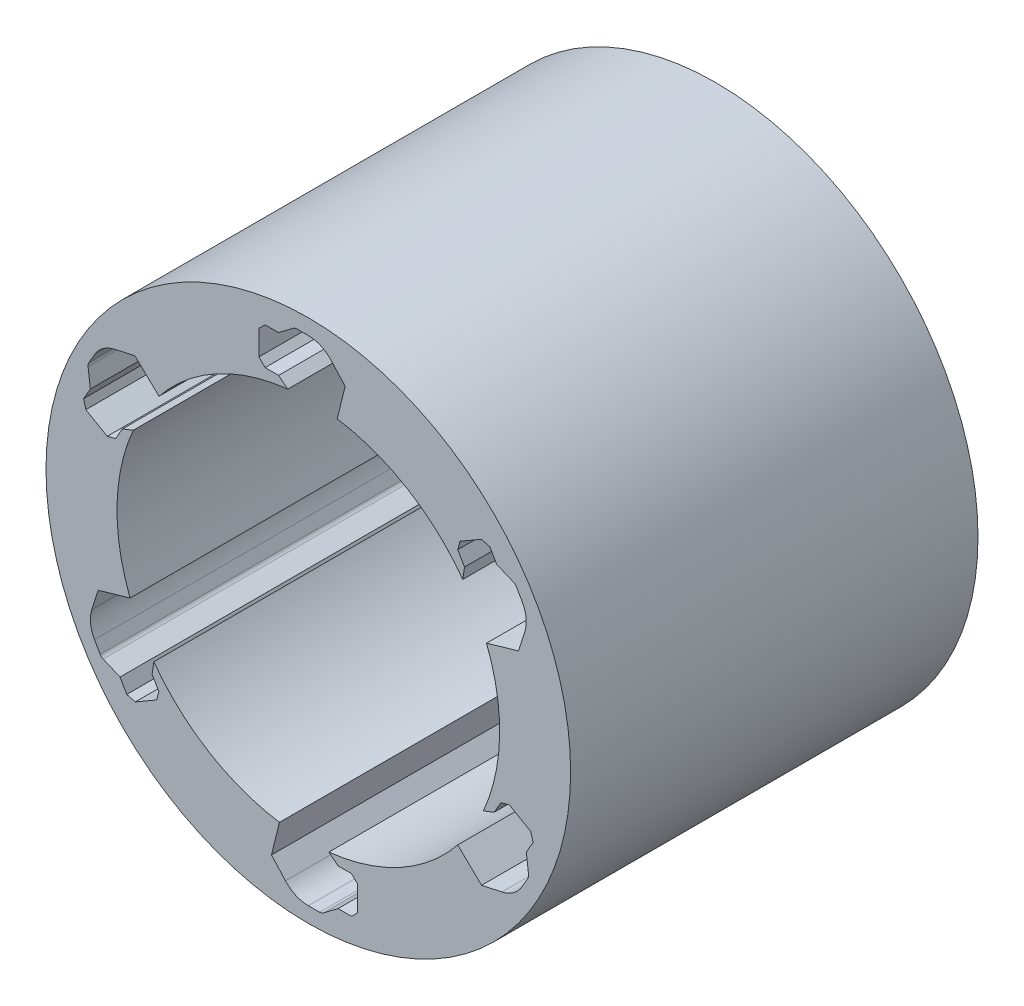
from build123d import *

# Parameters (mm, degrees)
ESQUISSE1_R                  = 4.25
ESQUISSE1_R_2                = 3.1
EXTRUSION1_DEPTH             = 6.6
ENL_V_START                  = -6.6
ENL_V_MAT_EXTRU_1_DEPTH      = 6.6
R_P_TITION_CIRCULAIRE1_COUNT = 6


with BuildPart() as part:
    # Esquisse1 → Extrusion1 (new body)
    with BuildSketch(Plane.XY):
        Circle(ESQUISSE1_R)
        Circle(ESQUISSE1_R_2, mode=Mode.SUBTRACT)
    extrude(amount=EXTRUSION1_DEPTH)

    # Esquisse2 → Enl_v. mat.-Extru.1 (cut)
    with BuildSketch(Plane.XY.offset(6.6).offset(ENL_V_START)):
        with BuildLine():
            Line((-0.8, 3.3), (-0.8, 3.7))
            Line((-0.8, 3.7), (-0.7, 3.8))
            Line((-0.7, 3.8), (-0.481304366, 3.8))
            Line((-0.481304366, 3.8), (-0.24397732, 3.979720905))
            ThreePointArc((-0.24397732, 3.979720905), (-0.215449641, 3.994794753), (-0.183606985, 4))
            Line((-0.183606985, 4), (0, 4))
            ThreePointArc((0, 4), (0.202547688, 3.957137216), (0.370368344, 3.835897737))
            Line((0.370368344, 3.835897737), (0.596642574, 3.58640272))
            Line((0.596642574, 3.58640272), (0.467674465, 3.064519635))
            ThreePointArc((0.467674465, 3.064519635), (0.068245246, 3.099248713), (-0.332325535, 3.082135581))
            Line((-0.332325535, 3.082135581), (-0.481304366, 3.2))
            Line((-0.481304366, 3.2), (-0.7, 3.2))
            Line((-0.7, 3.2), (-0.8, 3.3))
        make_face()
    enl_v_mat_extru_1 = extrude(amount=ENL_V_MAT_EXTRU_1_DEPTH, mode=Mode.SUBTRACT)

    # R_p_tition circulaire1: Enl_v. mat.-Extru.1 ×6 about axis
    r_p_tition_circulaire1_axis = Axis((0, 0, 0), (0, 0, 1))
    for i in range(1, R_P_TITION_CIRCULAIRE1_COUNT):
        add(enl_v_mat_extru_1.rotate(r_p_tition_circulaire1_axis, i * 360 / R_P_TITION_CIRCULAIRE1_COUNT), mode=Mode.SUBTRACT)


solid = part.part
